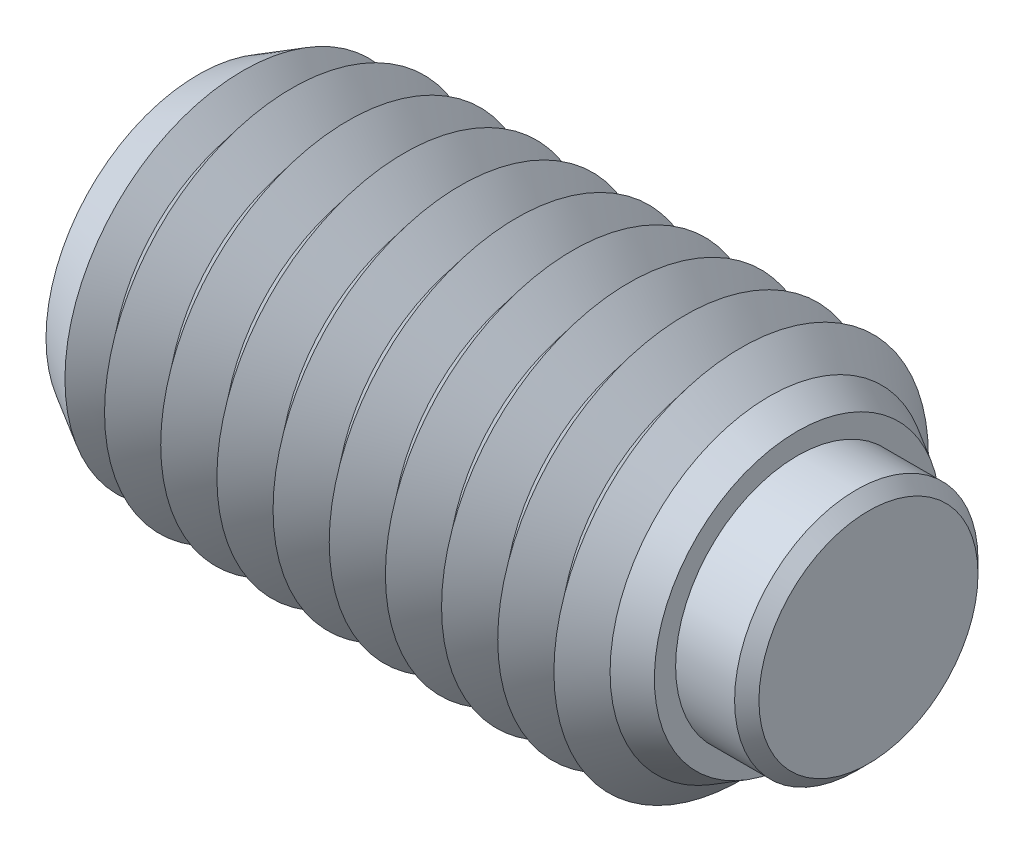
ISO-10303-21;
HEADER;
FILE_DESCRIPTION(('STEP AP214'),'2;1');
FILE_NAME('part.step','',(''),(''),'','','');
FILE_SCHEMA(('AUTOMOTIVE_DESIGN { 1 0 10303 214 1 1 1 1 }'));
ENDSEC;
DATA;
#1=APPLICATION_CONTEXT('core data for automotive mechanical design processes');
#2=APPLICATION_PROTOCOL_DEFINITION('international standard','automotive_design',2000,#1);
#3=PRODUCT_CONTEXT('',#1,'mechanical');
#4=PRODUCT('Part','Part','',(#3));
#5=PRODUCT_RELATED_PRODUCT_CATEGORY('part','',(#4));
#6=PRODUCT_DEFINITION_FORMATION('','',#4);
#7=PRODUCT_DEFINITION_CONTEXT('part definition',#1,'design');
#8=PRODUCT_DEFINITION('design','',#6,#7);
#9=PRODUCT_DEFINITION_SHAPE('','',#8);
#10=(LENGTH_UNIT() NAMED_UNIT(*) SI_UNIT(.MILLI.,.METRE.));
#11=(NAMED_UNIT(*) PLANE_ANGLE_UNIT() SI_UNIT($,.RADIAN.));
#12=(NAMED_UNIT(*) SI_UNIT($,.STERADIAN.) SOLID_ANGLE_UNIT());
#13=UNCERTAINTY_MEASURE_WITH_UNIT(LENGTH_MEASURE(1.E-05),#10,'distance_accuracy_value','');
#14=(GEOMETRIC_REPRESENTATION_CONTEXT(3) GLOBAL_UNCERTAINTY_ASSIGNED_CONTEXT((#13)) GLOBAL_UNIT_ASSIGNED_CONTEXT((#10,
#11,#12)) REPRESENTATION_CONTEXT('',''));
#15=CARTESIAN_POINT('',(0.,0.,0.));
#16=DIRECTION('',(0.,0.,1.));
#17=DIRECTION('',(1.,0.,0.));
#18=AXIS2_PLACEMENT_3D('',#15,#16,#17);
#19=CARTESIAN_POINT('',(2.65,0.,0.));
#20=DIRECTION('',(-1.,0.,0.));
#21=DIRECTION('',(0.,0.,1.));
#22=AXIS2_PLACEMENT_3D('',#19,#20,#21);
#23=CYLINDRICAL_SURFACE('',#22,3.25);
#24=CARTESIAN_POINT('',(2.325,0.,0.));
#25=DIRECTION('',(1.,0.,0.));
#26=DIRECTION('',(0.,0.,-1.));
#27=AXIS2_PLACEMENT_3D('',#24,#25,#26);
#28=CIRCLE('',#27,3.25);
#29=CARTESIAN_POINT('',(2.325,0.,3.25));
#30=VERTEX_POINT('',#29);
#31=EDGE_CURVE('P0_E10',#30,#30,#28,.F.);
#32=CARTESIAN_POINT('',(-1.15,0.,0.));
#33=DIRECTION('',(1.,0.,0.));
#34=DIRECTION('',(0.,0.,-1.));
#35=AXIS2_PLACEMENT_3D('',#32,#33,#34);
#36=CIRCLE('',#35,3.25);
#37=CARTESIAN_POINT('',(-1.15,0.,3.25));
#38=VERTEX_POINT('',#37);
#39=EDGE_CURVE('P0_E25',#38,#38,#36,.T.);
#40=CARTESIAN_POINT('',(2.325,0.,3.25));
#41=CARTESIAN_POINT('',(2.28880208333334,0.,3.25));
#42=CARTESIAN_POINT('',(2.25260416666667,0.,3.25));
#43=CARTESIAN_POINT('',(2.18020833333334,0.,3.25));
#44=CARTESIAN_POINT('',(2.14401041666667,0.,3.25));
#45=CARTESIAN_POINT('',(2.07161458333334,0.,3.25));
#46=CARTESIAN_POINT('',(2.03541666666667,0.,3.25));
#47=CARTESIAN_POINT('',(1.96302083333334,0.,3.25));
#48=CARTESIAN_POINT('',(1.92682291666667,0.,3.25));
#49=CARTESIAN_POINT('',(1.85442708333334,0.,3.25));
#50=CARTESIAN_POINT('',(1.81822916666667,0.,3.25));
#51=CARTESIAN_POINT('',(1.74583333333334,0.,3.25));
#52=CARTESIAN_POINT('',(1.70963541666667,0.,3.25));
#53=CARTESIAN_POINT('',(1.63723958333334,0.,3.25));
#54=CARTESIAN_POINT('',(1.60104166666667,0.,3.25));
#55=CARTESIAN_POINT('',(1.52864583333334,0.,3.25));
#56=CARTESIAN_POINT('',(1.49244791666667,0.,3.25));
#57=CARTESIAN_POINT('',(1.42005208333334,0.,3.25));
#58=CARTESIAN_POINT('',(1.38385416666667,0.,3.25));
#59=CARTESIAN_POINT('',(1.31145833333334,0.,3.25));
#60=CARTESIAN_POINT('',(1.27526041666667,0.,3.25));
#61=CARTESIAN_POINT('',(1.20286458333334,0.,3.25));
#62=CARTESIAN_POINT('',(1.16666666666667,0.,3.25));
#63=CARTESIAN_POINT('',(1.09427083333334,0.,3.25));
#64=CARTESIAN_POINT('',(1.05807291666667,0.,3.25));
#65=CARTESIAN_POINT('',(0.985677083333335,0.,3.25));
#66=CARTESIAN_POINT('',(0.949479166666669,0.,3.25));
#67=CARTESIAN_POINT('',(0.877083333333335,0.,3.25));
#68=CARTESIAN_POINT('',(0.840885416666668,0.,3.25));
#69=CARTESIAN_POINT('',(0.768489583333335,0.,3.25));
#70=CARTESIAN_POINT('',(0.732291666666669,0.,3.25));
#71=CARTESIAN_POINT('',(0.659895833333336,0.,3.25));
#72=CARTESIAN_POINT('',(0.623697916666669,0.,3.25));
#73=CARTESIAN_POINT('',(0.551302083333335,0.,3.25));
#74=CARTESIAN_POINT('',(0.515104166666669,0.,3.25));
#75=CARTESIAN_POINT('',(0.442708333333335,0.,3.25));
#76=CARTESIAN_POINT('',(0.406510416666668,0.,3.25));
#77=CARTESIAN_POINT('',(0.334114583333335,0.,3.25));
#78=CARTESIAN_POINT('',(0.297916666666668,0.,3.25));
#79=CARTESIAN_POINT('',(0.225520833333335,0.,3.25));
#80=CARTESIAN_POINT('',(0.189322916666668,0.,3.25));
#81=CARTESIAN_POINT('',(0.116927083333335,0.,3.25));
#82=CARTESIAN_POINT('',(0.0807291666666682,0.,3.25));
#83=CARTESIAN_POINT('',(0.00833333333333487,0.,3.25));
#84=CARTESIAN_POINT('',(-0.0278645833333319,0.,3.25));
#85=CARTESIAN_POINT('',(-0.100260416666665,0.,3.25));
#86=CARTESIAN_POINT('',(-0.136458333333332,0.,3.25));
#87=CARTESIAN_POINT('',(-0.208854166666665,0.,3.25));
#88=CARTESIAN_POINT('',(-0.245052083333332,0.,3.25));
#89=CARTESIAN_POINT('',(-0.317447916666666,0.,3.25));
#90=CARTESIAN_POINT('',(-0.353645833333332,0.,3.25));
#91=CARTESIAN_POINT('',(-0.426041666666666,0.,3.25));
#92=CARTESIAN_POINT('',(-0.462239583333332,0.,3.25));
#93=CARTESIAN_POINT('',(-0.534635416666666,0.,3.25));
#94=CARTESIAN_POINT('',(-0.570833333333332,0.,3.25));
#95=CARTESIAN_POINT('',(-0.643229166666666,0.,3.25));
#96=CARTESIAN_POINT('',(-0.679427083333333,0.,3.25));
#97=CARTESIAN_POINT('',(-0.751822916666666,0.,3.25));
#98=CARTESIAN_POINT('',(-0.788020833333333,0.,3.25));
#99=CARTESIAN_POINT('',(-0.860416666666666,0.,3.25));
#100=CARTESIAN_POINT('',(-0.896614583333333,0.,3.25));
#101=CARTESIAN_POINT('',(-0.969010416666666,0.,3.25));
#102=CARTESIAN_POINT('',(-1.00520833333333,0.,3.25));
#103=CARTESIAN_POINT('',(-1.07760416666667,0.,3.25));
#104=CARTESIAN_POINT('',(-1.11380208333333,0.,3.25));
#105=CARTESIAN_POINT('',(-1.15,0.,3.25));
#106=B_SPLINE_CURVE_WITH_KNOTS('',3,(#40,#41,#42,#43,#44,#45,#46,#47,#48,#49,#50,#51,#52,#53,
#54,#55,#56,#57,#58,#59,#60,#61,#62,#63,#64,#65,#66,#67,#68,#69,#70,#71,#72,#73,#74,#75,#76,#77,
#78,#79,#80,#81,#82,#83,#84,#85,#86,#87,#88,#89,#90,#91,#92,#93,#94,#95,#96,#97,#98,#99,#100,
#101,#102,#103,#104,#105),.UNSPECIFIED.,.F.,.F.,(4,2,2,2,2,2,2,2,2,2,2,2,2,2,2,2,2,2,2,2,2,2,2,
2,2,2,2,2,2,2,2,2,4),(0.,0.10859375,0.2171875,0.32578125,0.434375,0.54296875,0.6515625,
0.76015625,0.86875,0.977343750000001,1.0859375,1.19453125,1.303125,1.41171875,1.5203125,
1.62890625,1.7375,1.84609375,1.9546875,2.06328125,2.171875,2.28046875,2.3890625,2.49765625,
2.60625,2.71484375,2.8234375,2.93203125,3.040625,3.14921875,3.2578125,3.36640625,3.475),.UNSPECIFIED.);
#107=EDGE_CURVE('P0_BSEAM14',#30,#38,#106,.T.);
#108=ORIENTED_EDGE('',*,*,#31,.T.);
#109=ORIENTED_EDGE('',*,*,#39,.T.);
#110=ORIENTED_EDGE('',*,*,#107,.T.);
#111=ORIENTED_EDGE('',*,*,#107,.F.);
#112=EDGE_LOOP('',(#108,#110,#109,#111));
#113=FACE_BOUND('',#112,.T.);
#114=ADVANCED_FACE('P0_F14',(#113),#23,.T.);
#115=CARTESIAN_POINT('',(2.65,0.,0.));
#116=DIRECTION('',(1.,0.,0.));
#117=DIRECTION('',(0.,0.,-1.));
#118=AXIS2_PLACEMENT_3D('',#115,#116,#117);
#119=PLANE('',#118);
#120=CARTESIAN_POINT('',(2.65,0.,0.));
#121=DIRECTION('',(1.,0.,0.));
#122=DIRECTION('',(0.,0.,-1.));
#123=AXIS2_PLACEMENT_3D('',#120,#121,#122);
#124=CIRCLE('',#123,2.92500000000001);
#125=CARTESIAN_POINT('',(2.65,0.,-2.92500000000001));
#126=VERTEX_POINT('',#125);
#127=EDGE_CURVE('P0_E21',#126,#126,#124,.T.);
#128=ORIENTED_EDGE('',*,*,#127,.T.);
#129=EDGE_LOOP('',(#128));
#130=FACE_BOUND('',#129,.T.);
#131=ADVANCED_FACE('P0_F35',(#130),#119,.T.);
#132=CARTESIAN_POINT('',(-1.15,0.,0.));
#133=DIRECTION('',(1.,0.,0.));
#134=DIRECTION('',(0.,0.,-1.));
#135=AXIS2_PLACEMENT_3D('',#132,#133,#134);
#136=PLANE('',#135);
#137=ORIENTED_EDGE('',*,*,#39,.F.);
#138=EDGE_LOOP('',(#137));
#139=FACE_BOUND('',#138,.T.);
#140=ADVANCED_FACE('P0_F33',(#139),#136,.F.);
#141=CARTESIAN_POINT('',(2.65,0.,0.));
#142=DIRECTION('',(-1.,0.,0.));
#143=DIRECTION('',(0.,0.,1.));
#144=AXIS2_PLACEMENT_3D('',#141,#142,#143);
#145=CONICAL_SURFACE('',#144,2.92500000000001,0.785398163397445);
#146=ORIENTED_EDGE('',*,*,#31,.F.);
#147=EDGE_LOOP('',(#146));
#148=FACE_BOUND('',#147,.T.);
#149=ORIENTED_EDGE('',*,*,#127,.F.);
#150=EDGE_LOOP('',(#149));
#151=FACE_BOUND('',#150,.T.);
#152=ADVANCED_FACE('P0_F16',(#148,#151),#145,.T.);
#153=CLOSED_SHELL('',(#114,#131,#140,#152));
#154=MANIFOLD_SOLID_BREP('P0_B1',#153);
#155=CARTESIAN_POINT('',(-14.25,0.,0.));
#156=DIRECTION('',(-1.,0.,0.));
#157=DIRECTION('',(0.,0.,1.));
#158=AXIS2_PLACEMENT_3D('',#155,#156,#157);
#159=CONICAL_SURFACE('',#158,5.,0.895664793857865);
#160=CARTESIAN_POINT('',(-13.5,0.,0.));
#161=DIRECTION('',(1.,0.,0.));
#162=DIRECTION('',(0.,0.,-1.));
#163=AXIS2_PLACEMENT_3D('',#160,#161,#162);
#164=CIRCLE('',#163,4.06325030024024);
#165=CARTESIAN_POINT('',(-13.5,0.,-4.06325030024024));
#166=VERTEX_POINT('',#165);
#167=EDGE_CURVE('P1_E723',#166,#166,#164,.T.);
#168=ORIENTED_EDGE('',*,*,#167,.F.);
#169=EDGE_LOOP('',(#168));
#170=FACE_BOUND('',#169,.T.);
#171=CARTESIAN_POINT('',(-14.0532143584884,0.,0.));
#172=DIRECTION('',(1.,0.,0.));
#173=DIRECTION('',(0.,0.,-1.));
#174=AXIS2_PLACEMENT_3D('',#171,#172,#173);
#175=CIRCLE('',#174,4.75421481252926);
#176=CARTESIAN_POINT('',(-14.0532143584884,0.,-4.75421481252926));
#177=VERTEX_POINT('',#176);
#178=EDGE_CURVE('P1_E726',#177,#177,#175,.F.);
#179=ORIENTED_EDGE('',*,*,#178,.F.);
#180=EDGE_LOOP('',(#179));
#181=FACE_BOUND('',#180,.T.);
#182=ADVANCED_FACE('P1_F15',(#170,#181),#159,.T.);
#183=CARTESIAN_POINT('',(-1.5,0.,0.));
#184=DIRECTION('',(1.,0.,0.));
#185=DIRECTION('',(0.,0.,-1.));
#186=AXIS2_PLACEMENT_3D('',#183,#184,#185);
#187=CONICAL_SURFACE('',#186,4.06325030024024,0.895664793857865);
#188=CARTESIAN_POINT('',(-0.750000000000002,0.,0.));
#189=DIRECTION('',(1.,0.,0.));
#190=DIRECTION('',(0.,0.,-1.));
#191=AXIS2_PLACEMENT_3D('',#188,#189,#190);
#192=CIRCLE('',#191,5.);
#193=CARTESIAN_POINT('',(-0.750000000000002,0.,-5.));
#194=VERTEX_POINT('',#193);
#195=EDGE_CURVE('P1_E671',#194,#194,#192,.T.);
#196=ORIENTED_EDGE('',*,*,#195,.F.);
#197=EDGE_LOOP('',(#196));
#198=FACE_BOUND('',#197,.T.);
#199=CARTESIAN_POINT('',(-1.5,0.,0.));
#200=DIRECTION('',(1.,0.,0.));
#201=DIRECTION('',(0.,0.,-1.));
#202=AXIS2_PLACEMENT_3D('',#199,#200,#201);
#203=CIRCLE('',#202,4.06325030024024);
#204=CARTESIAN_POINT('',(-1.5,0.,-4.06325030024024));
#205=VERTEX_POINT('',#204);
#206=EDGE_CURVE('P1_E672',#205,#205,#203,.T.);
#207=ORIENTED_EDGE('',*,*,#206,.T.);
#208=EDGE_LOOP('',(#207));
#209=FACE_BOUND('',#208,.T.);
#210=ADVANCED_FACE('P1_F222',(#198,#209),#187,.T.);
#211=CARTESIAN_POINT('',(-2.25,0.,0.));
#212=DIRECTION('',(-1.,0.,0.));
#213=DIRECTION('',(0.,0.,1.));
#214=AXIS2_PLACEMENT_3D('',#211,#212,#213);
#215=CONICAL_SURFACE('',#214,5.,0.895664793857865);
#216=ORIENTED_EDGE('',*,*,#206,.F.);
#217=EDGE_LOOP('',(#216));
#218=FACE_BOUND('',#217,.T.);
#219=CARTESIAN_POINT('',(-2.25,0.,0.));
#220=DIRECTION('',(1.,0.,0.));
#221=DIRECTION('',(0.,0.,-1.));
#222=AXIS2_PLACEMENT_3D('',#219,#220,#221);
#223=CIRCLE('',#222,5.);
#224=CARTESIAN_POINT('',(-2.25,0.,-5.));
#225=VERTEX_POINT('',#224);
#226=EDGE_CURVE('P1_E676',#225,#225,#223,.T.);
#227=ORIENTED_EDGE('',*,*,#226,.T.);
#228=EDGE_LOOP('',(#227));
#229=FACE_BOUND('',#228,.T.);
#230=ADVANCED_FACE('P1_F227',(#218,#229),#215,.T.);
#231=CARTESIAN_POINT('',(-1.15,0.,0.));
#232=DIRECTION('',(1.,0.,0.));
#233=DIRECTION('',(0.,1.,0.));
#234=AXIS2_PLACEMENT_3D('',#231,#232,#233);
#235=PLANE('',#234);
#236=CARTESIAN_POINT('',(-1.15,0.,0.));
#237=DIRECTION('',(1.,0.,0.));
#238=DIRECTION('',(0.,1.,0.));
#239=AXIS2_PLACEMENT_3D('',#236,#237,#238);
#240=CIRCLE('',#239,3.25);
#241=CARTESIAN_POINT('',(-1.15,3.25,0.));
#242=VERTEX_POINT('',#241);
#243=EDGE_CURVE('P1_E366',#242,#242,#240,.T.);
#244=ORIENTED_EDGE('',*,*,#243,.T.);
#245=EDGE_LOOP('',(#244));
#246=FACE_BOUND('',#245,.T.);
#247=ADVANCED_FACE('P1_F293',(#246),#235,.T.);
#248=CARTESIAN_POINT('',(-1.15,0.,0.));
#249=DIRECTION('',(1.,0.,0.));
#250=DIRECTION('',(0.,1.,0.));
#251=AXIS2_PLACEMENT_3D('',#248,#249,#250);
#252=CYLINDRICAL_SURFACE('',#251,3.25);
#253=CARTESIAN_POINT('',(0.75,0.,0.));
#254=DIRECTION('',(1.,0.,0.));
#255=DIRECTION('',(0.,1.,0.));
#256=AXIS2_PLACEMENT_3D('',#253,#254,#255);
#257=CIRCLE('',#256,3.25);
#258=CARTESIAN_POINT('',(0.75,3.25,0.));
#259=VERTEX_POINT('',#258);
#260=EDGE_CURVE('P1_E369',#259,#259,#257,.T.);
#261=CARTESIAN_POINT('',(-1.15,3.25,0.));
#262=CARTESIAN_POINT('',(-1.13020833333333,3.25,0.));
#263=CARTESIAN_POINT('',(-1.11041666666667,3.25,0.));
#264=CARTESIAN_POINT('',(-1.07083333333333,3.25,0.));
#265=CARTESIAN_POINT('',(-1.05104166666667,3.25,0.));
#266=CARTESIAN_POINT('',(-1.01145833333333,3.25,0.));
#267=CARTESIAN_POINT('',(-0.991666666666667,3.25,0.));
#268=CARTESIAN_POINT('',(-0.952083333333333,3.25,0.));
#269=CARTESIAN_POINT('',(-0.932291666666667,3.25,0.));
#270=CARTESIAN_POINT('',(-0.892708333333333,3.25,0.));
#271=CARTESIAN_POINT('',(-0.872916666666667,3.25,0.));
#272=CARTESIAN_POINT('',(-0.833333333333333,3.25,0.));
#273=CARTESIAN_POINT('',(-0.813541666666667,3.25,0.));
#274=CARTESIAN_POINT('',(-0.773958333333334,3.25,0.));
#275=CARTESIAN_POINT('',(-0.754166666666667,3.25,0.));
#276=CARTESIAN_POINT('',(-0.714583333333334,3.25,0.));
#277=CARTESIAN_POINT('',(-0.694791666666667,3.25,0.));
#278=CARTESIAN_POINT('',(-0.655208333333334,3.25,0.));
#279=CARTESIAN_POINT('',(-0.635416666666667,3.25,0.));
#280=CARTESIAN_POINT('',(-0.595833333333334,3.25,0.));
#281=CARTESIAN_POINT('',(-0.576041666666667,3.25,0.));
#282=CARTESIAN_POINT('',(-0.536458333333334,3.25,0.));
#283=CARTESIAN_POINT('',(-0.516666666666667,3.25,0.));
#284=CARTESIAN_POINT('',(-0.477083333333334,3.25,0.));
#285=CARTESIAN_POINT('',(-0.457291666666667,3.25,0.));
#286=CARTESIAN_POINT('',(-0.417708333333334,3.25,0.));
#287=CARTESIAN_POINT('',(-0.397916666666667,3.25,0.));
#288=CARTESIAN_POINT('',(-0.358333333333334,3.25,0.));
#289=CARTESIAN_POINT('',(-0.338541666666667,3.25,0.));
#290=CARTESIAN_POINT('',(-0.298958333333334,3.25,0.));
#291=CARTESIAN_POINT('',(-0.279166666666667,3.25,0.));
#292=CARTESIAN_POINT('',(-0.239583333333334,3.25,0.));
#293=CARTESIAN_POINT('',(-0.219791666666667,3.25,0.));
#294=CARTESIAN_POINT('',(-0.180208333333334,3.25,0.));
#295=CARTESIAN_POINT('',(-0.160416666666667,3.25,0.));
#296=CARTESIAN_POINT('',(-0.120833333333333,3.25,0.));
#297=CARTESIAN_POINT('',(-0.101041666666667,3.25,0.));
#298=CARTESIAN_POINT('',(-0.0614583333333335,3.25,0.));
#299=CARTESIAN_POINT('',(-0.0416666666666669,3.25,0.));
#300=CARTESIAN_POINT('',(-0.00208333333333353,3.25,0.));
#301=CARTESIAN_POINT('',(0.0177083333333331,3.25,0.));
#302=CARTESIAN_POINT('',(0.0572916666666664,3.25,0.));
#303=CARTESIAN_POINT('',(0.0770833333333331,3.25,0.));
#304=CARTESIAN_POINT('',(0.116666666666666,3.25,0.));
#305=CARTESIAN_POINT('',(0.136458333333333,3.25,0.));
#306=CARTESIAN_POINT('',(0.176041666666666,3.25,0.));
#307=CARTESIAN_POINT('',(0.195833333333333,3.25,0.));
#308=CARTESIAN_POINT('',(0.235416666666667,3.25,0.));
#309=CARTESIAN_POINT('',(0.255208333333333,3.25,0.));
#310=CARTESIAN_POINT('',(0.294791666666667,3.25,0.));
#311=CARTESIAN_POINT('',(0.314583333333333,3.25,0.));
#312=CARTESIAN_POINT('',(0.354166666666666,3.25,0.));
#313=CARTESIAN_POINT('',(0.373958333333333,3.25,0.));
#314=CARTESIAN_POINT('',(0.413541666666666,3.25,0.));
#315=CARTESIAN_POINT('',(0.433333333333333,3.25,0.));
#316=CARTESIAN_POINT('',(0.472916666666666,3.25,0.));
#317=CARTESIAN_POINT('',(0.492708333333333,3.25,0.));
#318=CARTESIAN_POINT('',(0.532291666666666,3.25,0.));
#319=CARTESIAN_POINT('',(0.552083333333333,3.25,0.));
#320=CARTESIAN_POINT('',(0.591666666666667,3.25,0.));
#321=CARTESIAN_POINT('',(0.611458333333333,3.25,0.));
#322=CARTESIAN_POINT('',(0.651041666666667,3.25,0.));
#323=CARTESIAN_POINT('',(0.670833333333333,3.25,0.));
#324=CARTESIAN_POINT('',(0.710416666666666,3.25,0.));
#325=CARTESIAN_POINT('',(0.730208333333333,3.25,0.));
#326=CARTESIAN_POINT('',(0.75,3.25,0.));
#327=B_SPLINE_CURVE_WITH_KNOTS('',3,(#261,#262,#263,#264,#265,#266,#267,#268,#269,#270,#271,
#272,#273,#274,#275,#276,#277,#278,#279,#280,#281,#282,#283,#284,#285,#286,#287,#288,#289,#290,
#291,#292,#293,#294,#295,#296,#297,#298,#299,#300,#301,#302,#303,#304,#305,#306,#307,#308,#309,
#310,#311,#312,#313,#314,#315,#316,#317,#318,#319,#320,#321,#322,#323,#324,#325,#326),
.UNSPECIFIED.,.F.,.F.,(4,2,2,2,2,2,2,2,2,2,2,2,2,2,2,2,2,2,2,2,2,2,2,2,2,2,2,2,2,2,2,2,4),(0.,
0.059375,0.11875,0.178125,0.2375,0.296875,0.35625,0.415625,0.475,0.534375,0.59375,0.653125,
0.7125,0.771875,0.83125,0.890625,0.95,1.009375,1.06875,1.128125,1.1875,1.246875,1.30625,
1.365625,1.425,1.484375,1.54375,1.603125,1.6625,1.721875,1.78125,1.840625,1.9),.UNSPECIFIED.);
#328=EDGE_CURVE('P1_BSEAM209',#242,#259,#327,.T.);
#329=ORIENTED_EDGE('',*,*,#243,.F.);
#330=ORIENTED_EDGE('',*,*,#260,.T.);
#331=ORIENTED_EDGE('',*,*,#328,.T.);
#332=ORIENTED_EDGE('',*,*,#328,.F.);
#333=EDGE_LOOP('',(#329,#331,#330,#332));
#334=FACE_BOUND('',#333,.T.);
#335=ADVANCED_FACE('P1_F209',(#334),#252,.F.);
#336=CARTESIAN_POINT('',(0.75,3.81698729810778,0.));
#337=DIRECTION('',(1.,0.,0.));
#338=DIRECTION('',(0.,1.,0.));
#339=AXIS2_PLACEMENT_3D('',#336,#337,#338);
#340=PLANE('',#339);
#341=ORIENTED_EDGE('',*,*,#260,.F.);
#342=EDGE_LOOP('',(#341));
#343=FACE_BOUND('',#342,.T.);
#344=CARTESIAN_POINT('',(0.75,0.,0.));
#345=DIRECTION('',(1.,0.,0.));
#346=DIRECTION('',(0.,1.,0.));
#347=AXIS2_PLACEMENT_3D('',#344,#345,#346);
#348=CIRCLE('',#347,3.81698729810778);
#349=CARTESIAN_POINT('',(0.75,3.81698729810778,0.));
#350=VERTEX_POINT('',#349);
#351=EDGE_CURVE('P1_E121',#350,#350,#348,.T.);
#352=ORIENTED_EDGE('',*,*,#351,.T.);
#353=EDGE_LOOP('',(#352));
#354=FACE_BOUND('',#353,.T.);
#355=ADVANCED_FACE('P1_F206',(#343,#354),#340,.T.);
#356=CARTESIAN_POINT('',(0.75,0.,0.));
#357=DIRECTION('',(-1.,0.,0.));
#358=DIRECTION('',(0.,-1.,0.));
#359=AXIS2_PLACEMENT_3D('',#356,#357,#358);
#360=CONICAL_SURFACE('',#359,3.81698729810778,0.523598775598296);
#361=CARTESIAN_POINT('',(0.,0.,0.));
#362=DIRECTION('',(1.,0.,0.));
#363=DIRECTION('',(0.,0.,-1.));
#364=AXIS2_PLACEMENT_3D('',#361,#362,#363);
#365=CIRCLE('',#364,4.25);
#366=CARTESIAN_POINT('',(0.,0.,-4.25));
#367=VERTEX_POINT('',#366);
#368=EDGE_CURVE('P1_E357',#367,#367,#365,.T.);
#369=ORIENTED_EDGE('',*,*,#368,.T.);
#370=EDGE_LOOP('',(#369));
#371=FACE_BOUND('',#370,.T.);
#372=ORIENTED_EDGE('',*,*,#351,.F.);
#373=EDGE_LOOP('',(#372));
#374=FACE_BOUND('',#373,.T.);
#375=ADVANCED_FACE('P1_F203',(#371,#374),#360,.T.);
#376=CARTESIAN_POINT('',(0.,0.,0.));
#377=DIRECTION('',(-1.,0.,0.));
#378=DIRECTION('',(0.,0.,1.));
#379=AXIS2_PLACEMENT_3D('',#376,#377,#378);
#380=CONICAL_SURFACE('',#379,4.25,0.785398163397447);
#381=ORIENTED_EDGE('',*,*,#195,.T.);
#382=EDGE_LOOP('',(#381));
#383=FACE_BOUND('',#382,.T.);
#384=ORIENTED_EDGE('',*,*,#368,.F.);
#385=EDGE_LOOP('',(#384));
#386=FACE_BOUND('',#385,.T.);
#387=ADVANCED_FACE('P1_F17',(#383,#386),#380,.T.);
#388=CARTESIAN_POINT('',(-3.,0.,0.));
#389=DIRECTION('',(1.,0.,0.));
#390=DIRECTION('',(0.,0.,-1.));
#391=AXIS2_PLACEMENT_3D('',#388,#389,#390);
#392=CONICAL_SURFACE('',#391,4.06325030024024,0.895664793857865);
#393=ORIENTED_EDGE('',*,*,#226,.F.);
#394=EDGE_LOOP('',(#393));
#395=FACE_BOUND('',#394,.T.);
#396=CARTESIAN_POINT('',(-3.,0.,0.));
#397=DIRECTION('',(1.,0.,0.));
#398=DIRECTION('',(0.,0.,-1.));
#399=AXIS2_PLACEMENT_3D('',#396,#397,#398);
#400=CIRCLE('',#399,4.06325030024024);
#401=CARTESIAN_POINT('',(-3.,0.,-4.06325030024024));
#402=VERTEX_POINT('',#401);
#403=EDGE_CURVE('P1_E681',#402,#402,#400,.T.);
#404=ORIENTED_EDGE('',*,*,#403,.T.);
#405=EDGE_LOOP('',(#404));
#406=FACE_BOUND('',#405,.T.);
#407=ADVANCED_FACE('P1_F287',(#395,#406),#392,.T.);
#408=CARTESIAN_POINT('',(-3.75,0.,0.));
#409=DIRECTION('',(-1.,0.,0.));
#410=DIRECTION('',(0.,0.,1.));
#411=AXIS2_PLACEMENT_3D('',#408,#409,#410);
#412=CONICAL_SURFACE('',#411,5.,0.895664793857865);
#413=ORIENTED_EDGE('',*,*,#403,.F.);
#414=EDGE_LOOP('',(#413));
#415=FACE_BOUND('',#414,.T.);
#416=CARTESIAN_POINT('',(-3.75,0.,0.));
#417=DIRECTION('',(1.,0.,0.));
#418=DIRECTION('',(0.,0.,-1.));
#419=AXIS2_PLACEMENT_3D('',#416,#417,#418);
#420=CIRCLE('',#419,5.);
#421=CARTESIAN_POINT('',(-3.75,0.,-5.));
#422=VERTEX_POINT('',#421);
#423=EDGE_CURVE('P1_E684',#422,#422,#420,.T.);
#424=ORIENTED_EDGE('',*,*,#423,.T.);
#425=EDGE_LOOP('',(#424));
#426=FACE_BOUND('',#425,.T.);
#427=ADVANCED_FACE('P1_F283',(#415,#426),#412,.T.);
#428=CARTESIAN_POINT('',(-4.5,0.,0.));
#429=DIRECTION('',(1.,0.,0.));
#430=DIRECTION('',(0.,0.,-1.));
#431=AXIS2_PLACEMENT_3D('',#428,#429,#430);
#432=CONICAL_SURFACE('',#431,4.06325030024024,0.895664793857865);
#433=ORIENTED_EDGE('',*,*,#423,.F.);
#434=EDGE_LOOP('',(#433));
#435=FACE_BOUND('',#434,.T.);
#436=CARTESIAN_POINT('',(-4.5,0.,0.));
#437=DIRECTION('',(1.,0.,0.));
#438=DIRECTION('',(0.,0.,-1.));
#439=AXIS2_PLACEMENT_3D('',#436,#437,#438);
#440=CIRCLE('',#439,4.06325030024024);
#441=CARTESIAN_POINT('',(-4.5,0.,-4.06325030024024));
#442=VERTEX_POINT('',#441);
#443=EDGE_CURVE('P1_E687',#442,#442,#440,.T.);
#444=ORIENTED_EDGE('',*,*,#443,.T.);
#445=EDGE_LOOP('',(#444));
#446=FACE_BOUND('',#445,.T.);
#447=ADVANCED_FACE('P1_F279',(#435,#446),#432,.T.);
#448=CARTESIAN_POINT('',(-5.25,0.,0.));
#449=DIRECTION('',(-1.,0.,0.));
#450=DIRECTION('',(0.,0.,1.));
#451=AXIS2_PLACEMENT_3D('',#448,#449,#450);
#452=CONICAL_SURFACE('',#451,5.,0.895664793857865);
#453=ORIENTED_EDGE('',*,*,#443,.F.);
#454=EDGE_LOOP('',(#453));
#455=FACE_BOUND('',#454,.T.);
#456=CARTESIAN_POINT('',(-5.25,0.,0.));
#457=DIRECTION('',(1.,0.,0.));
#458=DIRECTION('',(0.,0.,-1.));
#459=AXIS2_PLACEMENT_3D('',#456,#457,#458);
#460=CIRCLE('',#459,5.);
#461=CARTESIAN_POINT('',(-5.25,0.,-5.));
#462=VERTEX_POINT('',#461);
#463=EDGE_CURVE('P1_E690',#462,#462,#460,.T.);
#464=ORIENTED_EDGE('',*,*,#463,.T.);
#465=EDGE_LOOP('',(#464));
#466=FACE_BOUND('',#465,.T.);
#467=ADVANCED_FACE('P1_F275',(#455,#466),#452,.T.);
#468=CARTESIAN_POINT('',(-6.,0.,0.));
#469=DIRECTION('',(1.,0.,0.));
#470=DIRECTION('',(0.,0.,-1.));
#471=AXIS2_PLACEMENT_3D('',#468,#469,#470);
#472=CONICAL_SURFACE('',#471,4.06325030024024,0.895664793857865);
#473=ORIENTED_EDGE('',*,*,#463,.F.);
#474=EDGE_LOOP('',(#473));
#475=FACE_BOUND('',#474,.T.);
#476=CARTESIAN_POINT('',(-6.,0.,0.));
#477=DIRECTION('',(1.,0.,0.));
#478=DIRECTION('',(0.,0.,-1.));
#479=AXIS2_PLACEMENT_3D('',#476,#477,#478);
#480=CIRCLE('',#479,4.06325030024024);
#481=CARTESIAN_POINT('',(-6.,0.,-4.06325030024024));
#482=VERTEX_POINT('',#481);
#483=EDGE_CURVE('P1_E693',#482,#482,#480,.T.);
#484=ORIENTED_EDGE('',*,*,#483,.T.);
#485=EDGE_LOOP('',(#484));
#486=FACE_BOUND('',#485,.T.);
#487=ADVANCED_FACE('P1_F271',(#475,#486),#472,.T.);
#488=CARTESIAN_POINT('',(-6.75,0.,0.));
#489=DIRECTION('',(-1.,0.,0.));
#490=DIRECTION('',(0.,0.,1.));
#491=AXIS2_PLACEMENT_3D('',#488,#489,#490);
#492=CONICAL_SURFACE('',#491,5.,0.895664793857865);
#493=ORIENTED_EDGE('',*,*,#483,.F.);
#494=EDGE_LOOP('',(#493));
#495=FACE_BOUND('',#494,.T.);
#496=CARTESIAN_POINT('',(-6.75,0.,0.));
#497=DIRECTION('',(1.,0.,0.));
#498=DIRECTION('',(0.,0.,-1.));
#499=AXIS2_PLACEMENT_3D('',#496,#497,#498);
#500=CIRCLE('',#499,5.);
#501=CARTESIAN_POINT('',(-6.75,0.,-5.));
#502=VERTEX_POINT('',#501);
#503=EDGE_CURVE('P1_E696',#502,#502,#500,.T.);
#504=ORIENTED_EDGE('',*,*,#503,.T.);
#505=EDGE_LOOP('',(#504));
#506=FACE_BOUND('',#505,.T.);
#507=ADVANCED_FACE('P1_F267',(#495,#506),#492,.T.);
#508=CARTESIAN_POINT('',(-7.5,0.,0.));
#509=DIRECTION('',(1.,0.,0.));
#510=DIRECTION('',(0.,0.,-1.));
#511=AXIS2_PLACEMENT_3D('',#508,#509,#510);
#512=CONICAL_SURFACE('',#511,4.06325030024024,0.895664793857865);
#513=ORIENTED_EDGE('',*,*,#503,.F.);
#514=EDGE_LOOP('',(#513));
#515=FACE_BOUND('',#514,.T.);
#516=CARTESIAN_POINT('',(-7.5,0.,0.));
#517=DIRECTION('',(1.,0.,0.));
#518=DIRECTION('',(0.,0.,-1.));
#519=AXIS2_PLACEMENT_3D('',#516,#517,#518);
#520=CIRCLE('',#519,4.06325030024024);
#521=CARTESIAN_POINT('',(-7.5,0.,-4.06325030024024));
#522=VERTEX_POINT('',#521);
#523=EDGE_CURVE('P1_E699',#522,#522,#520,.T.);
#524=ORIENTED_EDGE('',*,*,#523,.T.);
#525=EDGE_LOOP('',(#524));
#526=FACE_BOUND('',#525,.T.);
#527=ADVANCED_FACE('P1_F263',(#515,#526),#512,.T.);
#528=CARTESIAN_POINT('',(-8.25,0.,0.));
#529=DIRECTION('',(-1.,0.,0.));
#530=DIRECTION('',(0.,0.,1.));
#531=AXIS2_PLACEMENT_3D('',#528,#529,#530);
#532=CONICAL_SURFACE('',#531,5.,0.895664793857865);
#533=ORIENTED_EDGE('',*,*,#523,.F.);
#534=EDGE_LOOP('',(#533));
#535=FACE_BOUND('',#534,.T.);
#536=CARTESIAN_POINT('',(-8.25,0.,0.));
#537=DIRECTION('',(1.,0.,0.));
#538=DIRECTION('',(0.,0.,-1.));
#539=AXIS2_PLACEMENT_3D('',#536,#537,#538);
#540=CIRCLE('',#539,5.);
#541=CARTESIAN_POINT('',(-8.25,0.,-5.));
#542=VERTEX_POINT('',#541);
#543=EDGE_CURVE('P1_E702',#542,#542,#540,.T.);
#544=ORIENTED_EDGE('',*,*,#543,.T.);
#545=EDGE_LOOP('',(#544));
#546=FACE_BOUND('',#545,.T.);
#547=ADVANCED_FACE('P1_F259',(#535,#546),#532,.T.);
#548=CARTESIAN_POINT('',(-9.,0.,0.));
#549=DIRECTION('',(1.,0.,0.));
#550=DIRECTION('',(0.,0.,-1.));
#551=AXIS2_PLACEMENT_3D('',#548,#549,#550);
#552=CONICAL_SURFACE('',#551,4.06325030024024,0.895664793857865);
#553=ORIENTED_EDGE('',*,*,#543,.F.);
#554=EDGE_LOOP('',(#553));
#555=FACE_BOUND('',#554,.T.);
#556=CARTESIAN_POINT('',(-9.,0.,0.));
#557=DIRECTION('',(1.,0.,0.));
#558=DIRECTION('',(0.,0.,-1.));
#559=AXIS2_PLACEMENT_3D('',#556,#557,#558);
#560=CIRCLE('',#559,4.06325030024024);
#561=CARTESIAN_POINT('',(-9.,0.,-4.06325030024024));
#562=VERTEX_POINT('',#561);
#563=EDGE_CURVE('P1_E705',#562,#562,#560,.T.);
#564=ORIENTED_EDGE('',*,*,#563,.T.);
#565=EDGE_LOOP('',(#564));
#566=FACE_BOUND('',#565,.T.);
#567=ADVANCED_FACE('P1_F255',(#555,#566),#552,.T.);
#568=CARTESIAN_POINT('',(-9.75,0.,0.));
#569=DIRECTION('',(-1.,0.,0.));
#570=DIRECTION('',(0.,0.,1.));
#571=AXIS2_PLACEMENT_3D('',#568,#569,#570);
#572=CONICAL_SURFACE('',#571,5.,0.895664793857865);
#573=ORIENTED_EDGE('',*,*,#563,.F.);
#574=EDGE_LOOP('',(#573));
#575=FACE_BOUND('',#574,.T.);
#576=CARTESIAN_POINT('',(-9.75,0.,0.));
#577=DIRECTION('',(1.,0.,0.));
#578=DIRECTION('',(0.,0.,-1.));
#579=AXIS2_PLACEMENT_3D('',#576,#577,#578);
#580=CIRCLE('',#579,5.);
#581=CARTESIAN_POINT('',(-9.75,0.,-5.));
#582=VERTEX_POINT('',#581);
#583=EDGE_CURVE('P1_E708',#582,#582,#580,.T.);
#584=ORIENTED_EDGE('',*,*,#583,.T.);
#585=EDGE_LOOP('',(#584));
#586=FACE_BOUND('',#585,.T.);
#587=ADVANCED_FACE('P1_F251',(#575,#586),#572,.T.);
#588=CARTESIAN_POINT('',(-10.5,0.,0.));
#589=DIRECTION('',(1.,0.,0.));
#590=DIRECTION('',(0.,0.,-1.));
#591=AXIS2_PLACEMENT_3D('',#588,#589,#590);
#592=CONICAL_SURFACE('',#591,4.06325030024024,0.895664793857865);
#593=ORIENTED_EDGE('',*,*,#583,.F.);
#594=EDGE_LOOP('',(#593));
#595=FACE_BOUND('',#594,.T.);
#596=CARTESIAN_POINT('',(-10.5,0.,0.));
#597=DIRECTION('',(1.,0.,0.));
#598=DIRECTION('',(0.,0.,-1.));
#599=AXIS2_PLACEMENT_3D('',#596,#597,#598);
#600=CIRCLE('',#599,4.06325030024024);
#601=CARTESIAN_POINT('',(-10.5,0.,-4.06325030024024));
#602=VERTEX_POINT('',#601);
#603=EDGE_CURVE('P1_E711',#602,#602,#600,.T.);
#604=ORIENTED_EDGE('',*,*,#603,.T.);
#605=EDGE_LOOP('',(#604));
#606=FACE_BOUND('',#605,.T.);
#607=ADVANCED_FACE('P1_F247',(#595,#606),#592,.T.);
#608=CARTESIAN_POINT('',(-11.25,0.,0.));
#609=DIRECTION('',(-1.,0.,0.));
#610=DIRECTION('',(0.,0.,1.));
#611=AXIS2_PLACEMENT_3D('',#608,#609,#610);
#612=CONICAL_SURFACE('',#611,5.,0.895664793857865);
#613=ORIENTED_EDGE('',*,*,#603,.F.);
#614=EDGE_LOOP('',(#613));
#615=FACE_BOUND('',#614,.T.);
#616=CARTESIAN_POINT('',(-11.25,0.,0.));
#617=DIRECTION('',(1.,0.,0.));
#618=DIRECTION('',(0.,0.,-1.));
#619=AXIS2_PLACEMENT_3D('',#616,#617,#618);
#620=CIRCLE('',#619,5.);
#621=CARTESIAN_POINT('',(-11.25,0.,-5.));
#622=VERTEX_POINT('',#621);
#623=EDGE_CURVE('P1_E714',#622,#622,#620,.T.);
#624=ORIENTED_EDGE('',*,*,#623,.T.);
#625=EDGE_LOOP('',(#624));
#626=FACE_BOUND('',#625,.T.);
#627=ADVANCED_FACE('P1_F243',(#615,#626),#612,.T.);
#628=CARTESIAN_POINT('',(-12.,0.,0.));
#629=DIRECTION('',(1.,0.,0.));
#630=DIRECTION('',(0.,0.,-1.));
#631=AXIS2_PLACEMENT_3D('',#628,#629,#630);
#632=CONICAL_SURFACE('',#631,4.06325030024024,0.895664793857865);
#633=ORIENTED_EDGE('',*,*,#623,.F.);
#634=EDGE_LOOP('',(#633));
#635=FACE_BOUND('',#634,.T.);
#636=CARTESIAN_POINT('',(-12.,0.,0.));
#637=DIRECTION('',(1.,0.,0.));
#638=DIRECTION('',(0.,0.,-1.));
#639=AXIS2_PLACEMENT_3D('',#636,#637,#638);
#640=CIRCLE('',#639,4.06325030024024);
#641=CARTESIAN_POINT('',(-12.,0.,-4.06325030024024));
#642=VERTEX_POINT('',#641);
#643=EDGE_CURVE('P1_E717',#642,#642,#640,.T.);
#644=ORIENTED_EDGE('',*,*,#643,.T.);
#645=EDGE_LOOP('',(#644));
#646=FACE_BOUND('',#645,.T.);
#647=ADVANCED_FACE('P1_F239',(#635,#646),#632,.T.);
#648=CARTESIAN_POINT('',(-12.75,0.,0.));
#649=DIRECTION('',(-1.,0.,0.));
#650=DIRECTION('',(0.,0.,1.));
#651=AXIS2_PLACEMENT_3D('',#648,#649,#650);
#652=CONICAL_SURFACE('',#651,5.,0.895664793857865);
#653=ORIENTED_EDGE('',*,*,#643,.F.);
#654=EDGE_LOOP('',(#653));
#655=FACE_BOUND('',#654,.T.);
#656=CARTESIAN_POINT('',(-12.75,0.,0.));
#657=DIRECTION('',(1.,0.,0.));
#658=DIRECTION('',(0.,0.,-1.));
#659=AXIS2_PLACEMENT_3D('',#656,#657,#658);
#660=CIRCLE('',#659,5.);
#661=CARTESIAN_POINT('',(-12.75,0.,-5.));
#662=VERTEX_POINT('',#661);
#663=EDGE_CURVE('P1_E720',#662,#662,#660,.T.);
#664=ORIENTED_EDGE('',*,*,#663,.T.);
#665=EDGE_LOOP('',(#664));
#666=FACE_BOUND('',#665,.T.);
#667=ADVANCED_FACE('P1_F235',(#655,#666),#652,.T.);
#668=CARTESIAN_POINT('',(-13.5,0.,0.));
#669=DIRECTION('',(1.,0.,0.));
#670=DIRECTION('',(0.,0.,-1.));
#671=AXIS2_PLACEMENT_3D('',#668,#669,#670);
#672=CONICAL_SURFACE('',#671,4.06325030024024,0.895664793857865);
#673=ORIENTED_EDGE('',*,*,#663,.F.);
#674=EDGE_LOOP('',(#673));
#675=FACE_BOUND('',#674,.T.);
#676=ORIENTED_EDGE('',*,*,#167,.T.);
#677=EDGE_LOOP('',(#676));
#678=FACE_BOUND('',#677,.T.);
#679=ADVANCED_FACE('P1_F219',(#675,#678),#672,.T.);
#680=CARTESIAN_POINT('',(-15.25,0.,0.));
#681=DIRECTION('',(1.,0.,0.));
#682=DIRECTION('',(0.,0.,1.));
#683=AXIS2_PLACEMENT_3D('',#680,#681,#682);
#684=CONICAL_SURFACE('',#683,4.06325030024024,0.5235987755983);
#685=CARTESIAN_POINT('',(-15.25,0.,0.));
#686=DIRECTION('',(-1.,0.,0.));
#687=DIRECTION('',(0.,0.,1.));
#688=AXIS2_PLACEMENT_3D('',#685,#686,#687);
#689=CIRCLE('',#688,4.06325030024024);
#690=CARTESIAN_POINT('',(-15.25,0.,4.06325030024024));
#691=VERTEX_POINT('',#690);
#692=EDGE_CURVE('P1_E728',#691,#691,#689,.T.);
#693=ORIENTED_EDGE('',*,*,#692,.F.);
#694=EDGE_LOOP('',(#693));
#695=FACE_BOUND('',#694,.T.);
#696=ORIENTED_EDGE('',*,*,#178,.T.);
#697=EDGE_LOOP('',(#696));
#698=FACE_BOUND('',#697,.T.);
#699=ADVANCED_FACE('P1_F159',(#695,#698),#684,.T.);
#700=CARTESIAN_POINT('',(-15.25,0.,0.));
#701=DIRECTION('',(1.,0.,0.));
#702=DIRECTION('',(0.,0.,-1.));
#703=AXIS2_PLACEMENT_3D('',#700,#701,#702);
#704=PLANE('',#703);
#705=CARTESIAN_POINT('',(-15.25,0.,0.));
#706=DIRECTION('',(1.,0.,0.));
#707=DIRECTION('',(0.,0.,-1.));
#708=AXIS2_PLACEMENT_3D('',#705,#706,#707);
#709=CIRCLE('',#708,2.88675134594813);
#710=CARTESIAN_POINT('',(-15.25,-2.5,-1.44337567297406));
#711=VERTEX_POINT('',#710);
#712=CARTESIAN_POINT('',(-15.25,0.,-2.88675134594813));
#713=VERTEX_POINT('',#712);
#714=EDGE_CURVE('P1_E19',#711,#713,#709,.T.);
#715=ORIENTED_EDGE('',*,*,#714,.T.);
#716=CARTESIAN_POINT('',(-15.25,2.5,-1.44337567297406));
#717=VERTEX_POINT('',#716);
#718=EDGE_CURVE('P1_E10',#713,#717,#709,.T.);
#719=ORIENTED_EDGE('',*,*,#718,.T.);
#720=CARTESIAN_POINT('',(-15.25,2.5,1.44337567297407));
#721=VERTEX_POINT('',#720);
#722=EDGE_CURVE('P1_E24',#717,#721,#709,.T.);
#723=ORIENTED_EDGE('',*,*,#722,.T.);
#724=CARTESIAN_POINT('',(-15.25,0.,0.));
#725=DIRECTION('',(-1.,0.,0.));
#726=DIRECTION('',(0.,0.,1.));
#727=AXIS2_PLACEMENT_3D('',#724,#725,#726);
#728=CIRCLE('',#727,2.88675134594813);
#729=CARTESIAN_POINT('',(-15.25,0.,2.88675134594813));
#730=VERTEX_POINT('',#729);
#731=EDGE_CURVE('P1_E92',#730,#721,#728,.T.);
#732=ORIENTED_EDGE('',*,*,#731,.F.);
#733=CARTESIAN_POINT('',(-15.25,-2.5,1.44337567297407));
#734=VERTEX_POINT('',#733);
#735=EDGE_CURVE('P1_E101',#730,#734,#709,.T.);
#736=ORIENTED_EDGE('',*,*,#735,.T.);
#737=EDGE_CURVE('P1_E107',#734,#711,#709,.T.);
#738=ORIENTED_EDGE('',*,*,#737,.T.);
#739=EDGE_LOOP('',(#715,#719,#723,#732,#736,#738));
#740=FACE_BOUND('',#739,.T.);
#741=ORIENTED_EDGE('',*,*,#692,.T.);
#742=EDGE_LOOP('',(#741));
#743=FACE_BOUND('',#742,.T.);
#744=ADVANCED_FACE('P1_F108',(#740,#743),#704,.F.);
#745=CARTESIAN_POINT('',(-15.25,0.,0.));
#746=DIRECTION('',(-1.,0.,0.));
#747=DIRECTION('',(0.,0.,1.));
#748=AXIS2_PLACEMENT_3D('',#745,#746,#747);
#749=CONICAL_SURFACE('',#748,2.88675134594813,1.0471975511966);
#750=ORIENTED_EDGE('',*,*,#714,.F.);
#751=CARTESIAN_POINT('',(-15.2500666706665,0.000199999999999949,-2.88686681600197));
#752=CARTESIAN_POINT('',(-15.213430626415,-0.109663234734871,-2.82343724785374));
#753=CARTESIAN_POINT('',(-15.1801112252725,-0.220474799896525,-2.75946016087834));
#754=CARTESIAN_POINT('',(-15.1219512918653,-0.444016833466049,-2.63039810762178));
#755=CARTESIAN_POINT('',(-15.0971313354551,-0.556751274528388,-2.5653108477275));
#756=CARTESIAN_POINT('',(-15.0584946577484,-0.780822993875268,-2.43594298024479));
#757=CARTESIAN_POINT('',(-15.044420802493,-0.892125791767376,-2.37168227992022));
#758=CARTESIAN_POINT('',(-15.0276181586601,-1.11525522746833,-2.24285844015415));
#759=CARTESIAN_POINT('',(-15.024875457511,-1.22708105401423,-2.17829576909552));
#760=CARTESIAN_POINT('',(-15.0305747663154,-1.43604197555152,-2.05765212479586));
#761=CARTESIAN_POINT('',(-15.0376174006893,-1.53320831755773,-2.0015531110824));
#762=CARTESIAN_POINT('',(-15.0599404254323,-1.726907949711,-1.88972057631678));
#763=CARTESIAN_POINT('',(-15.0752284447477,-1.82344056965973,-1.8339874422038));
#764=CARTESIAN_POINT('',(-15.1134481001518,-2.01753972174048,-1.7219242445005));
#765=CARTESIAN_POINT('',(-15.1365417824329,-2.11508168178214,-1.66560836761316));
#766=CARTESIAN_POINT('',(-15.1889556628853,-2.30871060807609,-1.55381665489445));
#767=CARTESIAN_POINT('',(-15.2182635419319,-2.40480005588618,-1.49833938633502));
#768=CARTESIAN_POINT('',(-15.2500666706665,-2.5002,-1.44326020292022));
#769=B_SPLINE_CURVE_WITH_KNOTS('',3,(#751,#752,#753,#754,#755,#756,#757,#758,#759,#760,#761,
#762,#763,#764,#765,#766,#767,#768),.UNSPECIFIED.,.F.,.F.,(4,2,2,2,2,2,2,2,4),(0.,
0.396285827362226,0.79352433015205,1.18093086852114,1.56786160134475,1.90479741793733,
2.24204551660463,2.58677531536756,2.93082800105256),.UNSPECIFIED.);
#770=EDGE_CURVE('P1_E130',#713,#711,#769,.T.);
#771=ORIENTED_EDGE('',*,*,#770,.F.);
#772=EDGE_LOOP('',(#750,#771));
#773=FACE_BOUND('',#772,.T.);
#774=ADVANCED_FACE('P1_F158',(#773),#749,.F.);
#775=ORIENTED_EDGE('',*,*,#737,.F.);
#776=CARTESIAN_POINT('',(-16.1795882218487,-2.5,-3.73786280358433));
#777=CARTESIAN_POINT('',(-16.1277937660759,-2.5,-3.62990419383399));
#778=CARTESIAN_POINT('',(-16.0765372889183,-2.5,-3.52168258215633));
#779=CARTESIAN_POINT('',(-15.9754054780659,-2.5,-3.30457318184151));
#780=CARTESIAN_POINT('',(-15.92553039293,-2.5,-3.19568527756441));
#781=CARTESIAN_POINT('',(-15.82718792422,-2.5,-2.9764787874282));
#782=CARTESIAN_POINT('',(-15.7787309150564,-2.5,-2.86615552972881));
#783=CARTESIAN_POINT('',(-15.6839898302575,-2.5,-2.64458325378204));
#784=CARTESIAN_POINT('',(-15.6377056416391,-2.5,-2.53333428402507));
#785=CARTESIAN_POINT('',(-15.5467102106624,-2.5,-2.30680312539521));
#786=CARTESIAN_POINT('',(-15.5020717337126,-2.5,-2.19149153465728));
#787=CARTESIAN_POINT('',(-15.4165060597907,-2.5,-1.95947357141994));
#788=CARTESIAN_POINT('',(-15.3755792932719,-2.5,-1.84276703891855));
#789=CARTESIAN_POINT('',(-15.2986074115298,-2.5,-1.60804308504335));
#790=CARTESIAN_POINT('',(-15.2625510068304,-2.5,-1.49002940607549));
#791=CARTESIAN_POINT('',(-15.1965529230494,-2.5,-1.25231072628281));
#792=CARTESIAN_POINT('',(-15.1666097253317,-2.5,-1.13260615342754));
#793=CARTESIAN_POINT('',(-15.1144342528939,-2.5,-0.891755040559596));
#794=CARTESIAN_POINT('',(-15.0921861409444,-2.5,-0.770611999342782));
#795=CARTESIAN_POINT('',(-15.0568576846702,-2.5,-0.52697058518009));
#796=CARTESIAN_POINT('',(-15.0437767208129,-2.5,-0.404472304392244));
#797=CARTESIAN_POINT('',(-15.0279962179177,-2.5,-0.16026639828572));
#798=CARTESIAN_POINT('',(-15.0251741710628,-2.5,-0.0385668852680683));
#799=CARTESIAN_POINT('',(-15.0298357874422,-2.5,0.204641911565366));
#800=CARTESIAN_POINT('',(-15.0373200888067,-2.5,0.326151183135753));
#801=CARTESIAN_POINT('',(-15.058698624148,-2.5,0.536550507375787));
#802=CARTESIAN_POINT('',(-15.0704088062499,-2.5,0.625673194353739));
#803=CARTESIAN_POINT('',(-15.0985682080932,-2.5,0.803173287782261));
#804=CARTESIAN_POINT('',(-15.1150182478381,-2.5,0.891550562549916));
#805=CARTESIAN_POINT('',(-15.1706081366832,-2.5,1.15551872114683));
#806=CARTESIAN_POINT('',(-15.215972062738,-2.5,1.32980845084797));
#807=CARTESIAN_POINT('',(-15.2934741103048,-2.5,1.59042392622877));
#808=CARTESIAN_POINT('',(-15.3212456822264,-2.5,1.67812347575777));
#809=CARTESIAN_POINT('',(-15.3793570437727,-2.5,1.85261472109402));
#810=CARTESIAN_POINT('',(-15.409695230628,-2.5,1.93940694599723));
#811=CARTESIAN_POINT('',(-15.4725002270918,-2.5,2.11219305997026));
#812=CARTESIAN_POINT('',(-15.5049666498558,-2.5,2.19818709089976));
#813=CARTESIAN_POINT('',(-15.5716764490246,-2.5,2.36949800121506));
#814=CARTESIAN_POINT('',(-15.6059201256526,-2.5,2.45481476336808));
#815=CARTESIAN_POINT('',(-15.6955229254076,-2.5,2.67258848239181));
#816=CARTESIAN_POINT('',(-15.7519397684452,-2.5,2.80460967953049));
#817=CARTESIAN_POINT('',(-15.8674875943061,-2.5,3.06746265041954));
#818=CARTESIAN_POINT('',(-15.926618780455,-2.5,3.19829433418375));
#819=CARTESIAN_POINT('',(-16.0469788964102,-2.5,3.45901422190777));
#820=CARTESIAN_POINT('',(-16.1082081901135,-2.5,3.58890225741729));
#821=CARTESIAN_POINT('',(-16.2323019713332,-2.5,3.84789608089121));
#822=CARTESIAN_POINT('',(-16.295166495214,-2.5,3.97700185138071));
#823=CARTESIAN_POINT('',(-16.4858362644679,-2.5,4.36367805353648));
#824=CARTESIAN_POINT('',(-16.6155717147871,-2.5,4.62029579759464));
#825=CARTESIAN_POINT('',(-16.8783605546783,-2.5,5.13177424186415));
#826=CARTESIAN_POINT('',(-17.0114135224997,-2.5,5.38663516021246));
#827=CARTESIAN_POINT('',(-17.2671550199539,-2.5,5.8711418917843));
#828=CARTESIAN_POINT('',(-17.3896364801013,-2.5,6.10089718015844));
#829=CARTESIAN_POINT('',(-17.6359938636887,-2.5,6.55966877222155));
#830=CARTESIAN_POINT('',(-17.7598698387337,-2.5,6.78868504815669));
#831=CARTESIAN_POINT('',(-18.0083512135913,-2.5,7.24556639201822));
#832=CARTESIAN_POINT('',(-18.1329539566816,-2.5,7.47343290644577));
#833=CARTESIAN_POINT('',(-18.3829704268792,-2.5,7.92870524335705));
#834=CARTESIAN_POINT('',(-18.5083841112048,-2.5,8.15611108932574));
#835=CARTESIAN_POINT('',(-18.6340950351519,-2.5,8.38335143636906));
#836=B_SPLINE_CURVE_WITH_KNOTS('',3,(#776,#777,#778,#779,#780,#781,#782,#783,#784,#785,#786,
#787,#788,#789,#790,#791,#792,#793,#794,#795,#796,#797,#798,#799,#800,#801,#802,#803,#804,#805,
#806,#807,#808,#809,#810,#811,#812,#813,#814,#815,#816,#817,#818,#819,#820,#821,#822,#823,#824,
#825,#826,#827,#828,#829,#830,#831,#832,#833,#834,#835),.UNSPECIFIED.,.F.,.F.,(4,2,2,2,2,2,2,2,
2,2,2,2,2,2,2,2,2,2,2,2,2,2,2,2,2,2,2,2,2,4),(0.,0.359225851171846,0.718515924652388,
1.07998546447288,1.44143618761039,1.81233728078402,2.18328133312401,2.553350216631,
2.92332705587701,3.29253785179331,3.66172369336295,4.02648611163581,4.39127111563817,
4.66080405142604,4.93038364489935,5.46995614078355,5.74591174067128,6.02169626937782,
6.29743080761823,6.57321207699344,7.00387918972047,7.43457861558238,7.86535312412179,
8.29613722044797,9.15873745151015,10.0212285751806,10.8023128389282,11.5834261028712,
12.3625525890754,13.1416383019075),.UNSPECIFIED.);
#837=EDGE_CURVE('P1_E128',#711,#734,#836,.T.);
#838=ORIENTED_EDGE('',*,*,#837,.F.);
#839=EDGE_LOOP('',(#775,#838));
#840=FACE_BOUND('',#839,.T.);
#841=ADVANCED_FACE('P1_F217',(#840),#749,.F.);
#842=ORIENTED_EDGE('',*,*,#735,.F.);
#843=CARTESIAN_POINT('',(-15.2500666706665,-2.5002,1.44326020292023));
#844=CARTESIAN_POINT('',(-15.213430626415,-2.39033676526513,1.50668977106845));
#845=CARTESIAN_POINT('',(-15.1801112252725,-2.27952520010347,1.57066685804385));
#846=CARTESIAN_POINT('',(-15.1219512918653,-2.05598316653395,1.69972891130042));
#847=CARTESIAN_POINT('',(-15.0971313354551,-1.94324872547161,1.7648161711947));
#848=CARTESIAN_POINT('',(-15.0584946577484,-1.71917700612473,1.8941840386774));
#849=CARTESIAN_POINT('',(-15.044420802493,-1.60787420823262,1.95844473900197));
#850=CARTESIAN_POINT('',(-15.0276181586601,-1.38474477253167,2.08726857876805));
#851=CARTESIAN_POINT('',(-15.024875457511,-1.27291894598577,2.15183124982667));
#852=CARTESIAN_POINT('',(-15.0305747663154,-1.06395802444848,2.27247489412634));
#853=CARTESIAN_POINT('',(-15.0376174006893,-0.966791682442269,2.3285739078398));
#854=CARTESIAN_POINT('',(-15.0599404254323,-0.773092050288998,2.44040644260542));
#855=CARTESIAN_POINT('',(-15.0752284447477,-0.676559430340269,2.4961395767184));
#856=CARTESIAN_POINT('',(-15.1134481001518,-0.482460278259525,2.60820277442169));
#857=CARTESIAN_POINT('',(-15.1365417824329,-0.38491831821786,2.66451865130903));
#858=CARTESIAN_POINT('',(-15.1889556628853,-0.191289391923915,2.77631036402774));
#859=CARTESIAN_POINT('',(-15.2182635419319,-0.0951999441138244,2.83178763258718));
#860=CARTESIAN_POINT('',(-15.2500666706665,0.000199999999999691,2.88686681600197));
#861=B_SPLINE_CURVE_WITH_KNOTS('',3,(#843,#844,#845,#846,#847,#848,#849,#850,#851,#852,#853,
#854,#855,#856,#857,#858,#859,#860),.UNSPECIFIED.,.F.,.F.,(4,2,2,2,2,2,2,2,4),(0.,
0.396285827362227,0.793524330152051,1.18093086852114,1.56786160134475,1.90479741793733,
2.24204551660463,2.58677531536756,2.93082800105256),.UNSPECIFIED.);
#862=EDGE_CURVE('P1_E96',#734,#730,#861,.T.);
#863=ORIENTED_EDGE('',*,*,#862,.F.);
#864=EDGE_LOOP('',(#842,#863));
#865=FACE_BOUND('',#864,.T.);
#866=ADVANCED_FACE('P1_F102',(#865),#749,.F.);
#867=ORIENTED_EDGE('',*,*,#731,.T.);
#868=CARTESIAN_POINT('',(-15.2500666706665,-0.000200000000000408,2.88686681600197));
#869=CARTESIAN_POINT('',(-15.213430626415,0.109663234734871,2.82343724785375));
#870=CARTESIAN_POINT('',(-15.1801112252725,0.220474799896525,2.75946016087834));
#871=CARTESIAN_POINT('',(-15.1219512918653,0.444016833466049,2.63039810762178));
#872=CARTESIAN_POINT('',(-15.0971313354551,0.556751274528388,2.5653108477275));
#873=CARTESIAN_POINT('',(-15.0584946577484,0.780822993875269,2.43594298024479));
#874=CARTESIAN_POINT('',(-15.044420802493,0.892125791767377,2.37168227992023));
#875=CARTESIAN_POINT('',(-15.0276181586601,1.11525522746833,2.24285844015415));
#876=CARTESIAN_POINT('',(-15.024875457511,1.22708105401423,2.17829576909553));
#877=CARTESIAN_POINT('',(-15.0305747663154,1.43604197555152,2.05765212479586));
#878=CARTESIAN_POINT('',(-15.0376174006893,1.53320831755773,2.0015531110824));
#879=CARTESIAN_POINT('',(-15.0599404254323,1.726907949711,1.88972057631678));
#880=CARTESIAN_POINT('',(-15.0752284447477,1.82344056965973,1.8339874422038));
#881=CARTESIAN_POINT('',(-15.1134481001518,2.01753972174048,1.7219242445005));
#882=CARTESIAN_POINT('',(-15.1365417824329,2.11508168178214,1.66560836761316));
#883=CARTESIAN_POINT('',(-15.1889556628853,2.30871060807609,1.55381665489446));
#884=CARTESIAN_POINT('',(-15.2182635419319,2.40480005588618,1.49833938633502));
#885=CARTESIAN_POINT('',(-15.2500666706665,2.5002,1.44326020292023));
#886=B_SPLINE_CURVE_WITH_KNOTS('',3,(#868,#869,#870,#871,#872,#873,#874,#875,#876,#877,#878,
#879,#880,#881,#882,#883,#884,#885),.UNSPECIFIED.,.F.,.F.,(4,2,2,2,2,2,2,2,4),(0.,
0.396285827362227,0.793524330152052,1.18093086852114,1.56786160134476,1.90479741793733,
2.24204551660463,2.58677531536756,2.93082800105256),.UNSPECIFIED.);
#887=EDGE_CURVE('P1_E88',#730,#721,#886,.T.);
#888=ORIENTED_EDGE('',*,*,#887,.F.);
#889=EDGE_LOOP('',(#867,#888));
#890=FACE_BOUND('',#889,.T.);
#891=ADVANCED_FACE('P1_F90',(#890),#749,.F.);
#892=ORIENTED_EDGE('',*,*,#722,.F.);
#893=CARTESIAN_POINT('',(-16.1795882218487,2.5,-3.73786280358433));
#894=CARTESIAN_POINT('',(-16.1277937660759,2.5,-3.62990419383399));
#895=CARTESIAN_POINT('',(-16.0765372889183,2.5,-3.52168258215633));
#896=CARTESIAN_POINT('',(-15.9754054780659,2.5,-3.30457318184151));
#897=CARTESIAN_POINT('',(-15.92553039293,2.5,-3.19568527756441));
#898=CARTESIAN_POINT('',(-15.82718792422,2.5,-2.9764787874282));
#899=CARTESIAN_POINT('',(-15.7787309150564,2.5,-2.86615552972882));
#900=CARTESIAN_POINT('',(-15.6839898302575,2.5,-2.64458325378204));
#901=CARTESIAN_POINT('',(-15.6377056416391,2.5,-2.53333428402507));
#902=CARTESIAN_POINT('',(-15.5467102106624,2.5,-2.30680312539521));
#903=CARTESIAN_POINT('',(-15.5020717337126,2.5,-2.19149153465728));
#904=CARTESIAN_POINT('',(-15.4165060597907,2.5,-1.95947357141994));
#905=CARTESIAN_POINT('',(-15.3755792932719,2.5,-1.84276703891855));
#906=CARTESIAN_POINT('',(-15.2986074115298,2.5,-1.60804308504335));
#907=CARTESIAN_POINT('',(-15.2625510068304,2.5,-1.49002940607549));
#908=CARTESIAN_POINT('',(-15.1965529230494,2.5,-1.25231072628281));
#909=CARTESIAN_POINT('',(-15.1666097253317,2.5,-1.13260615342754));
#910=CARTESIAN_POINT('',(-15.1144342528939,2.5,-0.891755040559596));
#911=CARTESIAN_POINT('',(-15.0921861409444,2.5,-0.770611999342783));
#912=CARTESIAN_POINT('',(-15.0568576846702,2.5,-0.526970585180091));
#913=CARTESIAN_POINT('',(-15.0437767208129,2.5,-0.404472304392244));
#914=CARTESIAN_POINT('',(-15.0279962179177,2.5,-0.16026639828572));
#915=CARTESIAN_POINT('',(-15.0251741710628,2.5,-0.0385668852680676));
#916=CARTESIAN_POINT('',(-15.0298357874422,2.5,0.204641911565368));
#917=CARTESIAN_POINT('',(-15.0373200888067,2.5,0.326151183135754));
#918=CARTESIAN_POINT('',(-15.058698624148,2.5,0.536550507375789));
#919=CARTESIAN_POINT('',(-15.0704088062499,2.5,0.625673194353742));
#920=CARTESIAN_POINT('',(-15.0985682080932,2.5,0.803173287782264));
#921=CARTESIAN_POINT('',(-15.1150182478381,2.5,0.891550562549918));
#922=CARTESIAN_POINT('',(-15.1706081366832,2.5,1.15551872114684));
#923=CARTESIAN_POINT('',(-15.215972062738,2.5,1.32980845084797));
#924=CARTESIAN_POINT('',(-15.2934741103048,2.5,1.59042392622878));
#925=CARTESIAN_POINT('',(-15.3212456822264,2.5,1.67812347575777));
#926=CARTESIAN_POINT('',(-15.3793570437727,2.5,1.85261472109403));
#927=CARTESIAN_POINT('',(-15.409695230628,2.5,1.93940694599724));
#928=CARTESIAN_POINT('',(-15.4725002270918,2.5,2.11219305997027));
#929=CARTESIAN_POINT('',(-15.5049666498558,2.5,2.19818709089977));
#930=CARTESIAN_POINT('',(-15.5716764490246,2.5,2.36949800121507));
#931=CARTESIAN_POINT('',(-15.6059201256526,2.5,2.45481476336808));
#932=CARTESIAN_POINT('',(-15.6955229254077,2.5,2.67258848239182));
#933=CARTESIAN_POINT('',(-15.7519397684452,2.5,2.8046096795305));
#934=CARTESIAN_POINT('',(-15.8674875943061,2.5,3.06746265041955));
#935=CARTESIAN_POINT('',(-15.926618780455,2.5,3.19829433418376));
#936=CARTESIAN_POINT('',(-16.0469788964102,2.5,3.45901422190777));
#937=CARTESIAN_POINT('',(-16.1082081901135,2.5,3.58890225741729));
#938=CARTESIAN_POINT('',(-16.2323019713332,2.5,3.84789608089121));
#939=CARTESIAN_POINT('',(-16.295166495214,2.5,3.97700185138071));
#940=CARTESIAN_POINT('',(-16.4858362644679,2.5,4.36367805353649));
#941=CARTESIAN_POINT('',(-16.6155717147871,2.5,4.62029579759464));
#942=CARTESIAN_POINT('',(-16.8783605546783,2.5,5.13177424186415));
#943=CARTESIAN_POINT('',(-17.0114135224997,2.5,5.38663516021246));
#944=CARTESIAN_POINT('',(-17.267155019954,2.5,5.8711418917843));
#945=CARTESIAN_POINT('',(-17.3896364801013,2.5,6.10089718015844));
#946=CARTESIAN_POINT('',(-17.6359938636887,2.5,6.55966877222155));
#947=CARTESIAN_POINT('',(-17.7598698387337,2.5,6.78868504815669));
#948=CARTESIAN_POINT('',(-18.0083512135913,2.5,7.24556639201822));
#949=CARTESIAN_POINT('',(-18.1329539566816,2.5,7.47343290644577));
#950=CARTESIAN_POINT('',(-18.3829704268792,2.5,7.92870524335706));
#951=CARTESIAN_POINT('',(-18.5083841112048,2.5,8.15611108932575));
#952=CARTESIAN_POINT('',(-18.6340950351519,2.5,8.38335143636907));
#953=B_SPLINE_CURVE_WITH_KNOTS('',3,(#893,#894,#895,#896,#897,#898,#899,#900,#901,#902,#903,
#904,#905,#906,#907,#908,#909,#910,#911,#912,#913,#914,#915,#916,#917,#918,#919,#920,#921,#922,
#923,#924,#925,#926,#927,#928,#929,#930,#931,#932,#933,#934,#935,#936,#937,#938,#939,#940,#941,
#942,#943,#944,#945,#946,#947,#948,#949,#950,#951,#952),.UNSPECIFIED.,.F.,.F.,(4,2,2,2,2,2,2,2,
2,2,2,2,2,2,2,2,2,2,2,2,2,2,2,2,2,2,2,2,2,4),(0.,0.359225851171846,0.718515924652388,
1.07998546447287,1.44143618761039,1.81233728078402,2.18328133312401,2.553350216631,
2.92332705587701,3.29253785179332,3.66172369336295,4.02648611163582,4.39127111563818,
4.66080405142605,4.93038364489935,5.46995614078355,5.74591174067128,6.02169626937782,
6.29743080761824,6.57321207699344,7.00387918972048,7.43457861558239,7.8653531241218,
8.29613722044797,9.15873745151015,10.0212285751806,10.8023128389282,11.5834261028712,
12.3625525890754,13.1416383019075),.UNSPECIFIED.);
#954=EDGE_CURVE('P1_E97',#721,#717,#953,.F.);
#955=ORIENTED_EDGE('',*,*,#954,.F.);
#956=EDGE_LOOP('',(#892,#955));
#957=FACE_BOUND('',#956,.T.);
#958=ADVANCED_FACE('P1_F157',(#957),#749,.F.);
#959=ORIENTED_EDGE('',*,*,#718,.F.);
#960=CARTESIAN_POINT('',(-15.2500666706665,2.5002,-1.44326020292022));
#961=CARTESIAN_POINT('',(-15.213430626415,2.39033676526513,-1.50668977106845));
#962=CARTESIAN_POINT('',(-15.1801112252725,2.27952520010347,-1.57066685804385));
#963=CARTESIAN_POINT('',(-15.1219512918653,2.05598316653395,-1.69972891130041));
#964=CARTESIAN_POINT('',(-15.0971313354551,1.94324872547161,-1.7648161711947));
#965=CARTESIAN_POINT('',(-15.0584946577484,1.71917700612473,-1.8941840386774));
#966=CARTESIAN_POINT('',(-15.044420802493,1.60787420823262,-1.95844473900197));
#967=CARTESIAN_POINT('',(-15.0276181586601,1.38474477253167,-2.08726857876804));
#968=CARTESIAN_POINT('',(-15.024875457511,1.27291894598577,-2.15183124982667));
#969=CARTESIAN_POINT('',(-15.0305747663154,1.06395802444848,-2.27247489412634));
#970=CARTESIAN_POINT('',(-15.0376174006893,0.966791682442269,-2.32857390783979));
#971=CARTESIAN_POINT('',(-15.0599404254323,0.773092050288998,-2.44040644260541));
#972=CARTESIAN_POINT('',(-15.0752284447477,0.676559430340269,-2.49613957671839));
#973=CARTESIAN_POINT('',(-15.1134481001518,0.482460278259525,-2.60820277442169));
#974=CARTESIAN_POINT('',(-15.1365417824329,0.38491831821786,-2.66451865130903));
#975=CARTESIAN_POINT('',(-15.1889556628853,0.191289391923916,-2.77631036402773));
#976=CARTESIAN_POINT('',(-15.2182635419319,0.0951999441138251,-2.83178763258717));
#977=CARTESIAN_POINT('',(-15.2500666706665,-0.000199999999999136,-2.88686681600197));
#978=B_SPLINE_CURVE_WITH_KNOTS('',3,(#960,#961,#962,#963,#964,#965,#966,#967,#968,#969,#970,
#971,#972,#973,#974,#975,#976,#977),.UNSPECIFIED.,.F.,.F.,(4,2,2,2,2,2,2,2,4),(0.,
0.396285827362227,0.793524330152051,1.18093086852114,1.56786160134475,1.90479741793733,
2.24204551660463,2.58677531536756,2.93082800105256),.UNSPECIFIED.);
#979=EDGE_CURVE('P1_E178',#717,#713,#978,.T.);
#980=ORIENTED_EDGE('',*,*,#979,.F.);
#981=EDGE_LOOP('',(#959,#980));
#982=FACE_BOUND('',#981,.T.);
#983=ADVANCED_FACE('P1_F152',(#982),#749,.F.);
#984=CARTESIAN_POINT('',(-8.80662432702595,0.,0.));
#985=DIRECTION('',(-1.,0.,0.));
#986=DIRECTION('',(0.,-1.,0.));
#987=AXIS2_PLACEMENT_3D('',#984,#985,#986);
#988=CONICAL_SURFACE('',#987,0.,1.0471975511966);
#989=CARTESIAN_POINT('',(-10.25,0.,0.));
#990=DIRECTION('',(1.,0.,0.));
#991=DIRECTION('',(0.,1.,0.));
#992=AXIS2_PLACEMENT_3D('',#989,#990,#991);
#993=CIRCLE('',#992,2.5);
#994=CARTESIAN_POINT('',(-10.25,2.5,0.));
#995=VERTEX_POINT('',#994);
#996=CARTESIAN_POINT('',(-10.25,1.25,2.1650635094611));
#997=VERTEX_POINT('',#996);
#998=EDGE_CURVE('P1_E320',#995,#997,#993,.T.);
#999=ORIENTED_EDGE('',*,*,#998,.F.);
#1000=CARTESIAN_POINT('',(-10.25,1.25,-2.1650635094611));
#1001=VERTEX_POINT('',#1000);
#1002=EDGE_CURVE('P1_E359',#1001,#995,#993,.T.);
#1003=ORIENTED_EDGE('',*,*,#1002,.F.);
#1004=CARTESIAN_POINT('',(-10.25,-1.25,-2.1650635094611));
#1005=VERTEX_POINT('',#1004);
#1006=EDGE_CURVE('P1_E362',#1005,#1001,#993,.T.);
#1007=ORIENTED_EDGE('',*,*,#1006,.F.);
#1008=CARTESIAN_POINT('',(-10.25,-2.5,0.));
#1009=VERTEX_POINT('',#1008);
#1010=EDGE_CURVE('P1_E364',#1009,#1005,#993,.T.);
#1011=ORIENTED_EDGE('',*,*,#1010,.F.);
#1012=CARTESIAN_POINT('',(-10.25,-1.25,2.1650635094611));
#1013=VERTEX_POINT('',#1012);
#1014=EDGE_CURVE('P1_E372',#1013,#1009,#993,.T.);
#1015=ORIENTED_EDGE('',*,*,#1014,.F.);
#1016=EDGE_CURVE('P1_E367',#997,#1013,#993,.T.);
#1017=ORIENTED_EDGE('',*,*,#1016,.F.);
#1018=EDGE_LOOP('',(#999,#1003,#1007,#1011,#1015,#1017));
#1019=FACE_BOUND('',#1018,.T.);
#1020=CARTESIAN_POINT('',(-8.80662432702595,0.,0.));
#1021=VERTEX_POINT('',#1020);
#1022=VERTEX_LOOP('',#1021);
#1023=FACE_BOUND('',#1022,.T.);
#1024=ADVANCED_FACE('P1_F156',(#1019,#1023),#988,.F.);
#1025=CARTESIAN_POINT('',(-10.25,2.5,1.44337567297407));
#1026=DIRECTION('',(-1.,0.,0.));
#1027=DIRECTION('',(0.,0.,1.));
#1028=AXIS2_PLACEMENT_3D('',#1025,#1026,#1027);
#1029=PLANE('',#1028);
#1030=DIRECTION('',(0.,-0.866025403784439,0.5));
#1031=VECTOR('',#1030,1.);
#1032=CARTESIAN_POINT('',(-10.25,0.,-2.88675134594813));
#1033=LINE('',#1032,#1031);
#1034=CARTESIAN_POINT('',(-10.25,0.,-2.88675134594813));
#1035=VERTEX_POINT('',#1034);
#1036=EDGE_CURVE('P1_E333',#1035,#1005,#1033,.T.);
#1037=ORIENTED_EDGE('',*,*,#1036,.T.);
#1038=ORIENTED_EDGE('',*,*,#1006,.T.);
#1039=DIRECTION('',(0.,-0.866025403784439,-0.5));
#1040=VECTOR('',#1039,1.);
#1041=CARTESIAN_POINT('',(-10.25,2.5,-1.44337567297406));
#1042=LINE('',#1041,#1040);
#1043=EDGE_CURVE('P1_E323',#1001,#1035,#1042,.T.);
#1044=ORIENTED_EDGE('',*,*,#1043,.T.);
#1045=EDGE_LOOP('',(#1037,#1038,#1044));
#1046=FACE_BOUND('',#1045,.T.);
#1047=ADVANCED_FACE('P1_F303',(#1046),#1029,.T.);
#1048=DIRECTION('',(0.,0.,1.));
#1049=VECTOR('',#1048,1.);
#1050=CARTESIAN_POINT('',(-10.25,-2.5,-1.44337567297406));
#1051=LINE('',#1050,#1049);
#1052=CARTESIAN_POINT('',(-10.25,-2.5,-1.44337567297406));
#1053=VERTEX_POINT('',#1052);
#1054=EDGE_CURVE('P1_E337',#1053,#1009,#1051,.T.);
#1055=ORIENTED_EDGE('',*,*,#1054,.T.);
#1056=ORIENTED_EDGE('',*,*,#1010,.T.);
#1057=EDGE_CURVE('P1_E332',#1005,#1053,#1033,.T.);
#1058=ORIENTED_EDGE('',*,*,#1057,.T.);
#1059=EDGE_LOOP('',(#1055,#1056,#1058));
#1060=FACE_BOUND('',#1059,.T.);
#1061=ADVANCED_FACE('P1_F379',(#1060),#1029,.T.);
#1062=DIRECTION('',(0.,0.866025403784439,0.5));
#1063=VECTOR('',#1062,1.);
#1064=CARTESIAN_POINT('',(-10.25,-2.5,1.44337567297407));
#1065=LINE('',#1064,#1063);
#1066=CARTESIAN_POINT('',(-10.25,-2.5,1.44337567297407));
#1067=VERTEX_POINT('',#1066);
#1068=EDGE_CURVE('P1_E341',#1067,#1013,#1065,.T.);
#1069=ORIENTED_EDGE('',*,*,#1068,.T.);
#1070=ORIENTED_EDGE('',*,*,#1014,.T.);
#1071=EDGE_CURVE('P1_E336',#1009,#1067,#1051,.T.);
#1072=ORIENTED_EDGE('',*,*,#1071,.T.);
#1073=EDGE_LOOP('',(#1069,#1070,#1072));
#1074=FACE_BOUND('',#1073,.T.);
#1075=ADVANCED_FACE('P1_F314',(#1074),#1029,.T.);
#1076=DIRECTION('',(0.,0.866025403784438,-0.5));
#1077=VECTOR('',#1076,1.);
#1078=CARTESIAN_POINT('',(-10.25,0.,2.88675134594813));
#1079=LINE('',#1078,#1077);
#1080=CARTESIAN_POINT('',(-10.25,0.,2.88675134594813));
#1081=VERTEX_POINT('',#1080);
#1082=EDGE_CURVE('P1_E118',#1081,#997,#1079,.T.);
#1083=ORIENTED_EDGE('',*,*,#1082,.T.);
#1084=ORIENTED_EDGE('',*,*,#1016,.T.);
#1085=EDGE_CURVE('P1_E340',#1013,#1081,#1065,.T.);
#1086=ORIENTED_EDGE('',*,*,#1085,.T.);
#1087=EDGE_LOOP('',(#1083,#1084,#1086));
#1088=FACE_BOUND('',#1087,.T.);
#1089=ADVANCED_FACE('P1_F307',(#1088),#1029,.T.);
#1090=DIRECTION('',(0.,0.,-1.));
#1091=VECTOR('',#1090,1.);
#1092=CARTESIAN_POINT('',(-10.25,2.5,1.44337567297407));
#1093=LINE('',#1092,#1091);
#1094=CARTESIAN_POINT('',(-10.25,2.5,1.44337567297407));
#1095=VERTEX_POINT('',#1094);
#1096=EDGE_CURVE('P1_E319',#1095,#995,#1093,.T.);
#1097=ORIENTED_EDGE('',*,*,#1096,.T.);
#1098=ORIENTED_EDGE('',*,*,#998,.T.);
#1099=EDGE_CURVE('P1_E321',#997,#1095,#1079,.T.);
#1100=ORIENTED_EDGE('',*,*,#1099,.T.);
#1101=EDGE_LOOP('',(#1097,#1098,#1100));
#1102=FACE_BOUND('',#1101,.T.);
#1103=ADVANCED_FACE('P1_F305',(#1102),#1029,.T.);
#1104=CARTESIAN_POINT('',(-10.25,2.5,-1.44337567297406));
#1105=VERTEX_POINT('',#1104);
#1106=EDGE_CURVE('P1_E326',#1105,#1001,#1042,.T.);
#1107=ORIENTED_EDGE('',*,*,#1106,.T.);
#1108=ORIENTED_EDGE('',*,*,#1002,.T.);
#1109=EDGE_CURVE('P1_E324',#995,#1105,#1093,.T.);
#1110=ORIENTED_EDGE('',*,*,#1109,.T.);
#1111=EDGE_LOOP('',(#1107,#1108,#1110));
#1112=FACE_BOUND('',#1111,.T.);
#1113=ADVANCED_FACE('P1_F198',(#1112),#1029,.T.);
#1114=CARTESIAN_POINT('',(-10.25,2.5,1.44337567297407));
#1115=DIRECTION('',(0.,1.,0.));
#1116=DIRECTION('',(0.,0.,1.));
#1117=AXIS2_PLACEMENT_3D('',#1114,#1115,#1116);
#1118=PLANE('',#1117);
#1119=DIRECTION('',(-1.,0.,0.));
#1120=VECTOR('',#1119,1.);
#1121=CARTESIAN_POINT('',(-10.25,2.5,1.44337567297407));
#1122=LINE('',#1121,#1120);
#1123=EDGE_CURVE('P1_E343',#1095,#721,#1122,.T.);
#1124=ORIENTED_EDGE('',*,*,#1123,.T.);
#1125=ORIENTED_EDGE('',*,*,#954,.T.);
#1126=DIRECTION('',(-1.,0.,0.));
#1127=VECTOR('',#1126,1.);
#1128=CARTESIAN_POINT('',(-10.25,2.5,-1.44337567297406));
#1129=LINE('',#1128,#1127);
#1130=EDGE_CURVE('P1_E352',#1105,#717,#1129,.T.);
#1131=ORIENTED_EDGE('',*,*,#1130,.F.);
#1132=ORIENTED_EDGE('',*,*,#1109,.F.);
#1133=ORIENTED_EDGE('',*,*,#1096,.F.);
#1134=EDGE_LOOP('',(#1124,#1125,#1131,#1132,#1133));
#1135=FACE_BOUND('',#1134,.T.);
#1136=ADVANCED_FACE('P1_F195',(#1135),#1118,.F.);
#1137=CARTESIAN_POINT('',(-10.25,0.,2.88675134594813));
#1138=DIRECTION('',(0.,0.5,0.866025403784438));
#1139=DIRECTION('',(0.,-0.866025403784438,0.5));
#1140=AXIS2_PLACEMENT_3D('',#1137,#1138,#1139);
#1141=PLANE('',#1140);
#1142=DIRECTION('',(-1.,0.,0.));
#1143=VECTOR('',#1142,1.);
#1144=CARTESIAN_POINT('',(-10.25,0.,2.88675134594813));
#1145=LINE('',#1144,#1143);
#1146=EDGE_CURVE('P1_E114',#1081,#730,#1145,.T.);
#1147=ORIENTED_EDGE('',*,*,#1146,.T.);
#1148=ORIENTED_EDGE('',*,*,#887,.T.);
#1149=ORIENTED_EDGE('',*,*,#1123,.F.);
#1150=ORIENTED_EDGE('',*,*,#1099,.F.);
#1151=ORIENTED_EDGE('',*,*,#1082,.F.);
#1152=EDGE_LOOP('',(#1147,#1148,#1149,#1150,#1151));
#1153=FACE_BOUND('',#1152,.T.);
#1154=ADVANCED_FACE('P1_F115',(#1153),#1141,.F.);
#1155=CARTESIAN_POINT('',(-10.25,-2.5,1.44337567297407));
#1156=DIRECTION('',(0.,-0.5,0.866025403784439));
#1157=DIRECTION('',(0.,-0.866025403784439,-0.5));
#1158=AXIS2_PLACEMENT_3D('',#1155,#1156,#1157);
#1159=PLANE('',#1158);
#1160=DIRECTION('',(-1.,0.,0.));
#1161=VECTOR('',#1160,1.);
#1162=CARTESIAN_POINT('',(-10.25,-2.5,1.44337567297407));
#1163=LINE('',#1162,#1161);
#1164=EDGE_CURVE('P1_E122',#1067,#734,#1163,.T.);
#1165=ORIENTED_EDGE('',*,*,#1164,.T.);
#1166=ORIENTED_EDGE('',*,*,#862,.T.);
#1167=ORIENTED_EDGE('',*,*,#1146,.F.);
#1168=ORIENTED_EDGE('',*,*,#1085,.F.);
#1169=ORIENTED_EDGE('',*,*,#1068,.F.);
#1170=EDGE_LOOP('',(#1165,#1166,#1167,#1168,#1169));
#1171=FACE_BOUND('',#1170,.T.);
#1172=ADVANCED_FACE('P1_F124',(#1171),#1159,.F.);
#1173=CARTESIAN_POINT('',(-10.25,-2.5,-1.44337567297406));
#1174=DIRECTION('',(0.,-1.,0.));
#1175=DIRECTION('',(0.,0.,-1.));
#1176=AXIS2_PLACEMENT_3D('',#1173,#1174,#1175);
#1177=PLANE('',#1176);
#1178=DIRECTION('',(-1.,0.,0.));
#1179=VECTOR('',#1178,1.);
#1180=CARTESIAN_POINT('',(-10.25,-2.5,-1.44337567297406));
#1181=LINE('',#1180,#1179);
#1182=EDGE_CURVE('P1_E346',#1053,#711,#1181,.T.);
#1183=ORIENTED_EDGE('',*,*,#1182,.T.);
#1184=ORIENTED_EDGE('',*,*,#837,.T.);
#1185=ORIENTED_EDGE('',*,*,#1164,.F.);
#1186=ORIENTED_EDGE('',*,*,#1071,.F.);
#1187=ORIENTED_EDGE('',*,*,#1054,.F.);
#1188=EDGE_LOOP('',(#1183,#1184,#1185,#1186,#1187));
#1189=FACE_BOUND('',#1188,.T.);
#1190=ADVANCED_FACE('P1_F189',(#1189),#1177,.F.);
#1191=CARTESIAN_POINT('',(-10.25,0.,-2.88675134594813));
#1192=DIRECTION('',(0.,-0.5,-0.866025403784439));
#1193=DIRECTION('',(0.,0.866025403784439,-0.5));
#1194=AXIS2_PLACEMENT_3D('',#1191,#1192,#1193);
#1195=PLANE('',#1194);
#1196=DIRECTION('',(-1.,0.,0.));
#1197=VECTOR('',#1196,1.);
#1198=CARTESIAN_POINT('',(-10.25,0.,-2.88675134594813));
#1199=LINE('',#1198,#1197);
#1200=EDGE_CURVE('P1_E349',#1035,#713,#1199,.T.);
#1201=ORIENTED_EDGE('',*,*,#1200,.T.);
#1202=ORIENTED_EDGE('',*,*,#770,.T.);
#1203=ORIENTED_EDGE('',*,*,#1182,.F.);
#1204=ORIENTED_EDGE('',*,*,#1057,.F.);
#1205=ORIENTED_EDGE('',*,*,#1036,.F.);
#1206=EDGE_LOOP('',(#1201,#1202,#1203,#1204,#1205));
#1207=FACE_BOUND('',#1206,.T.);
#1208=ADVANCED_FACE('P1_F185',(#1207),#1195,.F.);
#1209=CARTESIAN_POINT('',(-10.25,2.5,-1.44337567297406));
#1210=DIRECTION('',(0.,0.5,-0.866025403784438));
#1211=DIRECTION('',(0.,0.866025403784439,0.5));
#1212=AXIS2_PLACEMENT_3D('',#1209,#1210,#1211);
#1213=PLANE('',#1212);
#1214=ORIENTED_EDGE('',*,*,#1130,.T.);
#1215=ORIENTED_EDGE('',*,*,#979,.T.);
#1216=ORIENTED_EDGE('',*,*,#1200,.F.);
#1217=ORIENTED_EDGE('',*,*,#1043,.F.);
#1218=ORIENTED_EDGE('',*,*,#1106,.F.);
#1219=EDGE_LOOP('',(#1214,#1215,#1216,#1217,#1218));
#1220=FACE_BOUND('',#1219,.T.);
#1221=ADVANCED_FACE('P1_F188',(#1220),#1213,.F.);
#1222=CLOSED_SHELL('',(#182,#210,#230,#247,#335,#355,#375,#387,#407,#427,#447,#467,#487,#507,
#527,#547,#567,#587,#607,#627,#647,#667,#679,#699,#744,#774,#841,#866,#891,#958,#983,#1024,
#1047,#1061,#1075,#1089,#1103,#1113,#1136,#1154,#1172,#1190,#1208,#1221));
#1223=MANIFOLD_SOLID_BREP('P1_B1',#1222);
#1224=ADVANCED_BREP_SHAPE_REPRESENTATION('',(#18,#154,#1223),#14);
#1225=SHAPE_DEFINITION_REPRESENTATION(#9,#1224);
ENDSEC;
END-ISO-10303-21;
